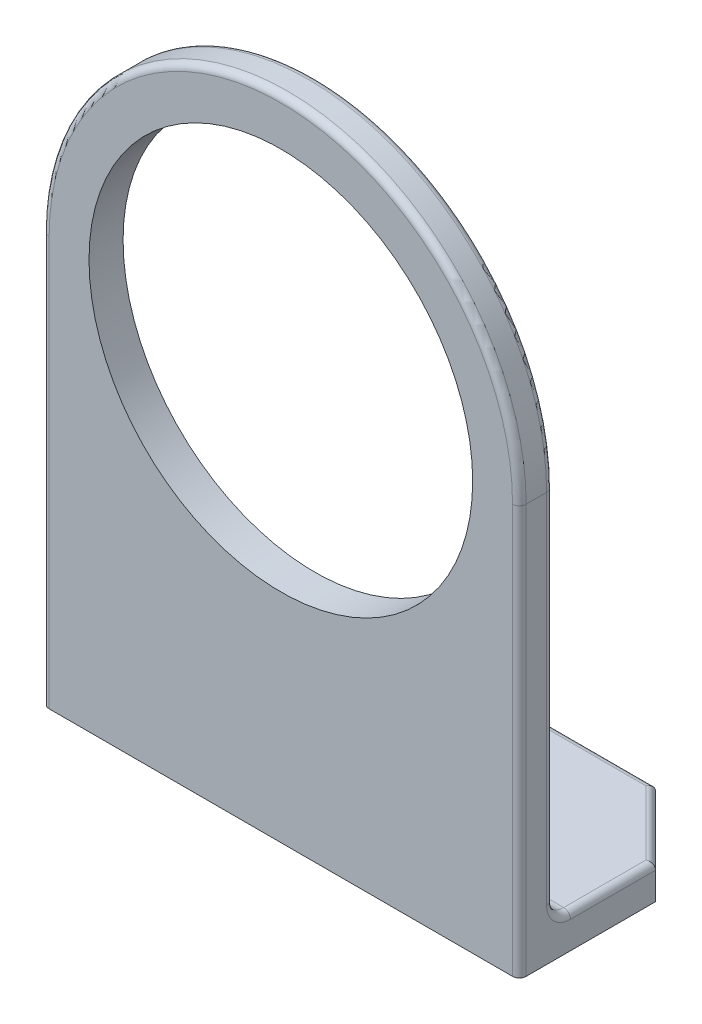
ISO-10303-21;
HEADER;
FILE_DESCRIPTION(('STEP AP214'),'2;1');
FILE_NAME('part.step','',(''),(''),'','','');
FILE_SCHEMA(('AUTOMOTIVE_DESIGN { 1 0 10303 214 1 1 1 1 }'));
ENDSEC;
DATA;
#1=APPLICATION_CONTEXT('core data for automotive mechanical design processes');
#2=APPLICATION_PROTOCOL_DEFINITION('international standard','automotive_design',2000,#1);
#3=PRODUCT_CONTEXT('',#1,'mechanical');
#4=PRODUCT('Part','Part','',(#3));
#5=PRODUCT_RELATED_PRODUCT_CATEGORY('part','',(#4));
#6=PRODUCT_DEFINITION_FORMATION('','',#4);
#7=PRODUCT_DEFINITION_CONTEXT('part definition',#1,'design');
#8=PRODUCT_DEFINITION('design','',#6,#7);
#9=PRODUCT_DEFINITION_SHAPE('','',#8);
#10=(LENGTH_UNIT() NAMED_UNIT(*) SI_UNIT(.MILLI.,.METRE.));
#11=(NAMED_UNIT(*) PLANE_ANGLE_UNIT() SI_UNIT($,.RADIAN.));
#12=(NAMED_UNIT(*) SI_UNIT($,.STERADIAN.) SOLID_ANGLE_UNIT());
#13=UNCERTAINTY_MEASURE_WITH_UNIT(LENGTH_MEASURE(1.E-05),#10,'distance_accuracy_value','');
#14=(GEOMETRIC_REPRESENTATION_CONTEXT(3) GLOBAL_UNCERTAINTY_ASSIGNED_CONTEXT((#13)) GLOBAL_UNIT_ASSIGNED_CONTEXT((#10,
#11,#12)) REPRESENTATION_CONTEXT('',''));
#15=CARTESIAN_POINT('',(0.,0.,0.));
#16=DIRECTION('',(0.,0.,1.));
#17=DIRECTION('',(1.,0.,0.));
#18=AXIS2_PLACEMENT_3D('',#15,#16,#17);
#19=CARTESIAN_POINT('',(-116.709331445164,-76.2,6.35));
#20=DIRECTION('',(0.,-1.,0.));
#21=DIRECTION('',(0.,0.,-1.));
#22=AXIS2_PLACEMENT_3D('',#19,#20,#21);
#23=PLANE('',#22);
#24=CARTESIAN_POINT('',(-22.225,-76.2,-9.52767255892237));
#25=DIRECTION('',(0.,1.,0.));
#26=DIRECTION('',(0.,0.,-1.));
#27=AXIS2_PLACEMENT_3D('',#24,#25,#26);
#28=CIRCLE('',#27,3.2512);
#29=CARTESIAN_POINT('',(-22.225,-76.2,-12.7788725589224));
#30=VERTEX_POINT('',#29);
#31=EDGE_CURVE('E637',#30,#30,#28,.T.);
#32=ORIENTED_EDGE('',*,*,#31,.T.);
#33=EDGE_LOOP('',(#32));
#34=FACE_BOUND('',#33,.T.);
#35=CARTESIAN_POINT('',(22.225,-76.2,-9.52767255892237));
#36=DIRECTION('',(0.,1.,0.));
#37=DIRECTION('',(0.,0.,1.));
#38=AXIS2_PLACEMENT_3D('',#35,#36,#37);
#39=CIRCLE('',#38,3.2512);
#40=CARTESIAN_POINT('',(22.225,-76.2,-6.27647255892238));
#41=VERTEX_POINT('',#40);
#42=EDGE_CURVE('E633',#41,#41,#39,.T.);
#43=ORIENTED_EDGE('',*,*,#42,.T.);
#44=EDGE_LOOP('',(#43));
#45=FACE_BOUND('',#44,.T.);
#46=CARTESIAN_POINT('',(0.,-76.2,-23.8151725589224));
#47=DIRECTION('',(0.,1.,0.));
#48=DIRECTION('',(0.,0.,1.));
#49=AXIS2_PLACEMENT_3D('',#46,#47,#48);
#50=CIRCLE('',#49,3.2512);
#51=CARTESIAN_POINT('',(0.,-76.2,-20.5639725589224));
#52=VERTEX_POINT('',#51);
#53=EDGE_CURVE('E166',#52,#52,#50,.T.);
#54=ORIENTED_EDGE('',*,*,#53,.T.);
#55=EDGE_LOOP('',(#54));
#56=FACE_BOUND('',#55,.T.);
#57=DIRECTION('',(0.,0.,-1.));
#58=VECTOR('',#57,1.);
#59=CARTESIAN_POINT('',(44.45,-76.2,6.35));
#60=LINE('',#59,#58);
#61=CARTESIAN_POINT('',(44.45,-76.2,5.08));
#62=VERTEX_POINT('',#61);
#63=CARTESIAN_POINT('',(44.45,-76.2,-19.05));
#64=VERTEX_POINT('',#63);
#65=EDGE_CURVE('E152',#62,#64,#60,.T.);
#66=ORIENTED_EDGE('',*,*,#65,.F.);
#67=CARTESIAN_POINT('',(43.18,-76.2,5.08));
#68=DIRECTION('',(0.,-1.,0.));
#69=DIRECTION('',(0.,0.,-1.));
#70=AXIS2_PLACEMENT_3D('',#67,#68,#69);
#71=CIRCLE('',#70,1.27);
#72=CARTESIAN_POINT('',(43.18,-76.2,6.35));
#73=VERTEX_POINT('',#72);
#74=EDGE_CURVE('E219',#62,#73,#71,.T.);
#75=ORIENTED_EDGE('',*,*,#74,.T.);
#76=DIRECTION('',(-1.,0.,0.));
#77=VECTOR('',#76,1.);
#78=CARTESIAN_POINT('',(-116.709331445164,-76.2,6.35));
#79=LINE('',#78,#77);
#80=CARTESIAN_POINT('',(-43.18,-76.2,6.35));
#81=VERTEX_POINT('',#80);
#82=EDGE_CURVE('E169',#73,#81,#79,.T.);
#83=ORIENTED_EDGE('',*,*,#82,.T.);
#84=CARTESIAN_POINT('',(-43.18,-76.2,5.08));
#85=DIRECTION('',(0.,-1.,0.));
#86=DIRECTION('',(0.,0.,-1.));
#87=AXIS2_PLACEMENT_3D('',#84,#85,#86);
#88=CIRCLE('',#87,1.27);
#89=CARTESIAN_POINT('',(-44.45,-76.2,5.08));
#90=VERTEX_POINT('',#89);
#91=EDGE_CURVE('E217',#81,#90,#88,.T.);
#92=ORIENTED_EDGE('',*,*,#91,.T.);
#93=DIRECTION('',(0.,0.,-1.));
#94=VECTOR('',#93,1.);
#95=CARTESIAN_POINT('',(-44.45,-76.2,6.35));
#96=LINE('',#95,#94);
#97=CARTESIAN_POINT('',(-44.45,-76.2,-19.05));
#98=VERTEX_POINT('',#97);
#99=EDGE_CURVE('E180',#90,#98,#96,.T.);
#100=ORIENTED_EDGE('',*,*,#99,.T.);
#101=DIRECTION('',(0.707106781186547,0.,-0.707106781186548));
#102=VECTOR('',#101,1.);
#103=CARTESIAN_POINT('',(-93.2796657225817,-76.2,29.7796657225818));
#104=LINE('',#103,#102);
#105=CARTESIAN_POINT('',(-31.75,-76.2,-31.75));
#106=VERTEX_POINT('',#105);
#107=EDGE_CURVE('E164',#98,#106,#104,.T.);
#108=ORIENTED_EDGE('',*,*,#107,.T.);
#109=DIRECTION('',(-1.,0.,0.));
#110=VECTOR('',#109,1.);
#111=CARTESIAN_POINT('',(44.45,-76.2,-31.75));
#112=LINE('',#111,#110);
#113=CARTESIAN_POINT('',(31.75,-76.2,-31.75));
#114=VERTEX_POINT('',#113);
#115=EDGE_CURVE('E148',#114,#106,#112,.T.);
#116=ORIENTED_EDGE('',*,*,#115,.F.);
#117=DIRECTION('',(-0.707106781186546,0.,-0.707106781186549));
#118=VECTOR('',#117,1.);
#119=CARTESIAN_POINT('',(-23.4296657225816,-76.2,-86.9296657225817));
#120=LINE('',#119,#118);
#121=EDGE_CURVE('E151',#114,#64,#120,.F.);
#122=ORIENTED_EDGE('',*,*,#121,.T.);
#123=EDGE_LOOP('',(#66,#75,#83,#92,#100,#108,#116,#122));
#124=FACE_BOUND('',#123,.T.);
#125=ADVANCED_FACE('F32',(#34,#45,#56,#124),#23,.T.);
#126=CARTESIAN_POINT('',(44.45,-15.875,6.35));
#127=DIRECTION('',(-1.,0.,0.));
#128=DIRECTION('',(0.,-1.,0.));
#129=AXIS2_PLACEMENT_3D('',#126,#127,#128);
#130=PLANE('',#129);
#131=DIRECTION('',(0.,0.,-1.));
#132=VECTOR('',#131,1.);
#133=CARTESIAN_POINT('',(44.45,0.,6.35));
#134=LINE('',#133,#132);
#135=CARTESIAN_POINT('',(44.45,0.,5.08));
#136=VERTEX_POINT('',#135);
#137=CARTESIAN_POINT('',(44.45,0.,1.27));
#138=VERTEX_POINT('',#137);
#139=EDGE_CURVE('E186',#136,#138,#134,.T.);
#140=ORIENTED_EDGE('',*,*,#139,.F.);
#141=DIRECTION('',(0.,1.,0.));
#142=VECTOR('',#141,1.);
#143=CARTESIAN_POINT('',(44.45,-15.875,5.08));
#144=LINE('',#143,#142);
#145=EDGE_CURVE('E215',#136,#62,#144,.F.);
#146=ORIENTED_EDGE('',*,*,#145,.T.);
#147=ORIENTED_EDGE('',*,*,#65,.T.);
#148=DIRECTION('',(0.,1.,0.));
#149=VECTOR('',#148,1.);
#150=CARTESIAN_POINT('',(44.45,-15.875,-19.05));
#151=LINE('',#150,#149);
#152=CARTESIAN_POINT('',(44.45,-71.12,-19.05));
#153=VERTEX_POINT('',#152);
#154=EDGE_CURVE('E158',#64,#153,#151,.T.);
#155=ORIENTED_EDGE('',*,*,#154,.T.);
#156=DIRECTION('',(0.,0.,1.));
#157=VECTOR('',#156,1.);
#158=CARTESIAN_POINT('',(44.45,-71.12,6.35));
#159=LINE('',#158,#157);
#160=CARTESIAN_POINT('',(44.45,-71.12,-3.175));
#161=VERTEX_POINT('',#160);
#162=EDGE_CURVE('E209',#153,#161,#159,.T.);
#163=ORIENTED_EDGE('',*,*,#162,.T.);
#164=CARTESIAN_POINT('',(44.45,-66.675,-3.175));
#165=DIRECTION('',(-1.,0.,0.));
#166=DIRECTION('',(0.,-1.,0.));
#167=AXIS2_PLACEMENT_3D('',#164,#165,#166);
#168=CIRCLE('',#167,4.445);
#169=CARTESIAN_POINT('',(44.45,-66.675,1.27));
#170=VERTEX_POINT('',#169);
#171=EDGE_CURVE('E211',#161,#170,#168,.T.);
#172=ORIENTED_EDGE('',*,*,#171,.T.);
#173=DIRECTION('',(0.,1.,0.));
#174=VECTOR('',#173,1.);
#175=CARTESIAN_POINT('',(44.45,0.,1.27));
#176=LINE('',#175,#174);
#177=EDGE_CURVE('E213',#170,#138,#176,.T.);
#178=ORIENTED_EDGE('',*,*,#177,.T.);
#179=EDGE_LOOP('',(#140,#146,#147,#155,#163,#172,#178));
#180=FACE_BOUND('',#179,.T.);
#181=ADVANCED_FACE('F341',(#180),#130,.F.);
#182=CARTESIAN_POINT('',(0.,0.,6.35));
#183=DIRECTION('',(0.,0.,-1.));
#184=DIRECTION('',(-1.,0.,0.));
#185=AXIS2_PLACEMENT_3D('',#182,#183,#184);
#186=CYLINDRICAL_SURFACE('',#185,44.45);
#187=DIRECTION('',(0.,0.,-1.));
#188=VECTOR('',#187,1.);
#189=CARTESIAN_POINT('',(-44.45,0.,6.35));
#190=LINE('',#189,#188);
#191=CARTESIAN_POINT('',(-44.45,0.,5.08));
#192=VERTEX_POINT('',#191);
#193=CARTESIAN_POINT('',(-44.45,0.,1.27));
#194=VERTEX_POINT('',#193);
#195=EDGE_CURVE('E183',#192,#194,#190,.T.);
#196=ORIENTED_EDGE('',*,*,#195,.F.);
#197=CARTESIAN_POINT('',(0.,0.,5.08));
#198=DIRECTION('',(0.,0.,-1.));
#199=DIRECTION('',(-1.,0.,0.));
#200=AXIS2_PLACEMENT_3D('',#197,#198,#199);
#201=CIRCLE('',#200,44.45);
#202=EDGE_CURVE('E223',#192,#136,#201,.T.);
#203=ORIENTED_EDGE('',*,*,#202,.T.);
#204=ORIENTED_EDGE('',*,*,#139,.T.);
#205=CARTESIAN_POINT('',(0.,0.,1.27));
#206=DIRECTION('',(0.,0.,-1.));
#207=DIRECTION('',(-1.,0.,0.));
#208=AXIS2_PLACEMENT_3D('',#205,#206,#207);
#209=CIRCLE('',#208,44.45);
#210=EDGE_CURVE('E221',#138,#194,#209,.F.);
#211=ORIENTED_EDGE('',*,*,#210,.T.);
#212=EDGE_LOOP('',(#196,#203,#204,#211));
#213=FACE_BOUND('',#212,.T.);
#214=ADVANCED_FACE('F344',(#213),#186,.T.);
#215=CARTESIAN_POINT('',(-44.45,-15.875,6.35));
#216=DIRECTION('',(-1.,0.,0.));
#217=DIRECTION('',(0.,-1.,0.));
#218=AXIS2_PLACEMENT_3D('',#215,#216,#217);
#219=PLANE('',#218);
#220=ORIENTED_EDGE('',*,*,#99,.F.);
#221=DIRECTION('',(0.,1.,0.));
#222=VECTOR('',#221,1.);
#223=CARTESIAN_POINT('',(-44.45,0.,5.08));
#224=LINE('',#223,#222);
#225=EDGE_CURVE('E232',#90,#192,#224,.T.);
#226=ORIENTED_EDGE('',*,*,#225,.T.);
#227=ORIENTED_EDGE('',*,*,#195,.T.);
#228=DIRECTION('',(0.,1.,0.));
#229=VECTOR('',#228,1.);
#230=CARTESIAN_POINT('',(-44.45,-15.875,1.27));
#231=LINE('',#230,#229);
#232=CARTESIAN_POINT('',(-44.45,-66.675,1.27));
#233=VERTEX_POINT('',#232);
#234=EDGE_CURVE('E230',#194,#233,#231,.F.);
#235=ORIENTED_EDGE('',*,*,#234,.T.);
#236=CARTESIAN_POINT('',(-44.45,-66.675,-3.175));
#237=DIRECTION('',(-1.,0.,0.));
#238=DIRECTION('',(0.,-1.,0.));
#239=AXIS2_PLACEMENT_3D('',#236,#237,#238);
#240=CIRCLE('',#239,4.445);
#241=CARTESIAN_POINT('',(-44.45,-71.12,-3.175));
#242=VERTEX_POINT('',#241);
#243=EDGE_CURVE('E227',#233,#242,#240,.F.);
#244=ORIENTED_EDGE('',*,*,#243,.T.);
#245=DIRECTION('',(0.,0.,1.));
#246=VECTOR('',#245,1.);
#247=CARTESIAN_POINT('',(-44.45,-71.12,-19.05));
#248=LINE('',#247,#246);
#249=CARTESIAN_POINT('',(-44.45,-71.12,-19.05));
#250=VERTEX_POINT('',#249);
#251=EDGE_CURVE('E225',#242,#250,#248,.F.);
#252=ORIENTED_EDGE('',*,*,#251,.T.);
#253=DIRECTION('',(0.,-1.,0.));
#254=VECTOR('',#253,1.);
#255=CARTESIAN_POINT('',(-44.45,-76.2,-19.05));
#256=LINE('',#255,#254);
#257=EDGE_CURVE('E193',#250,#98,#256,.T.);
#258=ORIENTED_EDGE('',*,*,#257,.T.);
#259=EDGE_LOOP('',(#220,#226,#227,#235,#244,#252,#258));
#260=FACE_BOUND('',#259,.T.);
#261=ADVANCED_FACE('F321',(#260),#219,.T.);
#262=CARTESIAN_POINT('',(0.,0.,6.35));
#263=DIRECTION('',(0.,0.,-1.));
#264=DIRECTION('',(-1.,0.,0.));
#265=AXIS2_PLACEMENT_3D('',#262,#263,#264);
#266=CYLINDRICAL_SURFACE('',#265,35.75);
#267=CARTESIAN_POINT('',(0.,0.,6.35));
#268=DIRECTION('',(0.,0.,-1.));
#269=DIRECTION('',(-1.,0.,0.));
#270=AXIS2_PLACEMENT_3D('',#267,#268,#269);
#271=CIRCLE('',#270,35.75);
#272=CARTESIAN_POINT('',(-35.75,0.,6.35));
#273=VERTEX_POINT('',#272);
#274=EDGE_CURVE('E178',#273,#273,#271,.T.);
#275=ORIENTED_EDGE('',*,*,#274,.F.);
#276=EDGE_LOOP('',(#275));
#277=FACE_BOUND('',#276,.T.);
#278=CARTESIAN_POINT('',(0.,0.,0.));
#279=DIRECTION('',(0.,0.,-1.));
#280=DIRECTION('',(-1.,0.,0.));
#281=AXIS2_PLACEMENT_3D('',#278,#279,#280);
#282=CIRCLE('',#281,35.75);
#283=CARTESIAN_POINT('',(-35.75,0.,0.));
#284=VERTEX_POINT('',#283);
#285=EDGE_CURVE('E165',#284,#284,#282,.T.);
#286=ORIENTED_EDGE('',*,*,#285,.T.);
#287=EDGE_LOOP('',(#286));
#288=FACE_BOUND('',#287,.T.);
#289=ADVANCED_FACE('F556',(#277,#288),#266,.F.);
#290=CARTESIAN_POINT('',(-116.709331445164,-15.875,6.35));
#291=DIRECTION('',(0.,0.,-1.));
#292=DIRECTION('',(-1.,0.,0.));
#293=AXIS2_PLACEMENT_3D('',#290,#291,#292);
#294=PLANE('',#293);
#295=ORIENTED_EDGE('',*,*,#82,.F.);
#296=DIRECTION('',(0.,1.,0.));
#297=VECTOR('',#296,1.);
#298=CARTESIAN_POINT('',(43.18,-15.875,6.35));
#299=LINE('',#298,#297);
#300=CARTESIAN_POINT('',(43.18,0.,6.35));
#301=VERTEX_POINT('',#300);
#302=EDGE_CURVE('E206',#73,#301,#299,.T.);
#303=ORIENTED_EDGE('',*,*,#302,.T.);
#304=CARTESIAN_POINT('',(0.,0.,6.35));
#305=DIRECTION('',(0.,0.,-1.));
#306=DIRECTION('',(-1.,0.,0.));
#307=AXIS2_PLACEMENT_3D('',#304,#305,#306);
#308=CIRCLE('',#307,43.18);
#309=CARTESIAN_POINT('',(-43.18,0.,6.35));
#310=VERTEX_POINT('',#309);
#311=EDGE_CURVE('E204',#301,#310,#308,.F.);
#312=ORIENTED_EDGE('',*,*,#311,.T.);
#313=DIRECTION('',(0.,1.,0.));
#314=VECTOR('',#313,1.);
#315=CARTESIAN_POINT('',(-43.18,-76.2,6.35));
#316=LINE('',#315,#314);
#317=EDGE_CURVE('E202',#310,#81,#316,.F.);
#318=ORIENTED_EDGE('',*,*,#317,.T.);
#319=EDGE_LOOP('',(#295,#303,#312,#318));
#320=FACE_BOUND('',#319,.T.);
#321=ORIENTED_EDGE('',*,*,#274,.T.);
#322=EDGE_LOOP('',(#321));
#323=FACE_BOUND('',#322,.T.);
#324=ADVANCED_FACE('F358',(#320,#323),#294,.F.);
#325=CARTESIAN_POINT('',(-116.709331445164,-15.875,0.));
#326=DIRECTION('',(0.,0.,-1.));
#327=DIRECTION('',(-1.,0.,0.));
#328=AXIS2_PLACEMENT_3D('',#325,#326,#327);
#329=PLANE('',#328);
#330=DIRECTION('',(1.,0.,0.));
#331=VECTOR('',#330,1.);
#332=CARTESIAN_POINT('',(-116.709331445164,-66.675,0.));
#333=LINE('',#332,#331);
#334=CARTESIAN_POINT('',(43.18,-66.675,0.));
#335=VERTEX_POINT('',#334);
#336=CARTESIAN_POINT('',(-43.18,-66.675,0.));
#337=VERTEX_POINT('',#336);
#338=EDGE_CURVE('E199',#335,#337,#333,.F.);
#339=ORIENTED_EDGE('',*,*,#338,.T.);
#340=DIRECTION('',(0.,1.,0.));
#341=VECTOR('',#340,1.);
#342=CARTESIAN_POINT('',(-43.18,-15.875,0.));
#343=LINE('',#342,#341);
#344=CARTESIAN_POINT('',(-43.18,0.,0.));
#345=VERTEX_POINT('',#344);
#346=EDGE_CURVE('E243',#337,#345,#343,.T.);
#347=ORIENTED_EDGE('',*,*,#346,.T.);
#348=CARTESIAN_POINT('',(0.,0.,0.));
#349=DIRECTION('',(0.,0.,-1.));
#350=DIRECTION('',(-1.,0.,0.));
#351=AXIS2_PLACEMENT_3D('',#348,#349,#350);
#352=CIRCLE('',#351,43.18);
#353=CARTESIAN_POINT('',(43.18,0.,0.));
#354=VERTEX_POINT('',#353);
#355=EDGE_CURVE('E241',#345,#354,#352,.T.);
#356=ORIENTED_EDGE('',*,*,#355,.T.);
#357=DIRECTION('',(0.,1.,0.));
#358=VECTOR('',#357,1.);
#359=CARTESIAN_POINT('',(43.18,-66.675,0.));
#360=LINE('',#359,#358);
#361=EDGE_CURVE('E239',#354,#335,#360,.F.);
#362=ORIENTED_EDGE('',*,*,#361,.T.);
#363=EDGE_LOOP('',(#339,#347,#356,#362));
#364=FACE_BOUND('',#363,.T.);
#365=ORIENTED_EDGE('',*,*,#285,.F.);
#366=EDGE_LOOP('',(#365));
#367=FACE_BOUND('',#366,.T.);
#368=ADVANCED_FACE('F329',(#364,#367),#329,.T.);
#369=CARTESIAN_POINT('',(44.45,-69.85,-31.75));
#370=DIRECTION('',(0.,-1.,0.));
#371=DIRECTION('',(0.,0.,-1.));
#372=AXIS2_PLACEMENT_3D('',#369,#370,#371);
#373=PLANE('',#372);
#374=CARTESIAN_POINT('',(-22.225,-69.85,-9.52767255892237));
#375=DIRECTION('',(0.,1.,0.));
#376=DIRECTION('',(0.,0.,-1.));
#377=AXIS2_PLACEMENT_3D('',#374,#375,#376);
#378=CIRCLE('',#377,3.2512);
#379=CARTESIAN_POINT('',(-22.225,-69.85,-12.7788725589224));
#380=VERTEX_POINT('',#379);
#381=EDGE_CURVE('E263',#380,#380,#378,.T.);
#382=ORIENTED_EDGE('',*,*,#381,.F.);
#383=EDGE_LOOP('',(#382));
#384=FACE_BOUND('',#383,.T.);
#385=CARTESIAN_POINT('',(22.225,-69.85,-9.52767255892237));
#386=DIRECTION('',(0.,1.,0.));
#387=DIRECTION('',(0.,0.,1.));
#388=AXIS2_PLACEMENT_3D('',#385,#386,#387);
#389=CIRCLE('',#388,3.2512);
#390=CARTESIAN_POINT('',(22.225,-69.85,-6.27647255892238));
#391=VERTEX_POINT('',#390);
#392=EDGE_CURVE('E629',#391,#391,#389,.T.);
#393=ORIENTED_EDGE('',*,*,#392,.F.);
#394=EDGE_LOOP('',(#393));
#395=FACE_BOUND('',#394,.T.);
#396=CARTESIAN_POINT('',(0.,-69.85,-23.8151725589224));
#397=DIRECTION('',(0.,1.,0.));
#398=DIRECTION('',(0.,0.,1.));
#399=AXIS2_PLACEMENT_3D('',#396,#397,#398);
#400=CIRCLE('',#399,3.2512);
#401=CARTESIAN_POINT('',(0.,-69.85,-20.5639725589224));
#402=VERTEX_POINT('',#401);
#403=EDGE_CURVE('E172',#402,#402,#400,.T.);
#404=ORIENTED_EDGE('',*,*,#403,.F.);
#405=EDGE_LOOP('',(#404));
#406=FACE_BOUND('',#405,.T.);
#407=DIRECTION('',(1.,0.,0.));
#408=VECTOR('',#407,1.);
#409=CARTESIAN_POINT('',(44.45,-69.85,-3.175));
#410=LINE('',#409,#408);
#411=CARTESIAN_POINT('',(-43.18,-69.85,-3.175));
#412=VERTEX_POINT('',#411);
#413=CARTESIAN_POINT('',(43.18,-69.85,-3.175));
#414=VERTEX_POINT('',#413);
#415=EDGE_CURVE('E196',#412,#414,#410,.T.);
#416=ORIENTED_EDGE('',*,*,#415,.T.);
#417=DIRECTION('',(0.,0.,1.));
#418=VECTOR('',#417,1.);
#419=CARTESIAN_POINT('',(43.18,-69.85,-31.75));
#420=LINE('',#419,#418);
#421=CARTESIAN_POINT('',(43.18,-69.85,-18.5239487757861));
#422=VERTEX_POINT('',#421);
#423=EDGE_CURVE('E253',#414,#422,#420,.F.);
#424=ORIENTED_EDGE('',*,*,#423,.T.);
#425=DIRECTION('',(0.707106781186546,0.,0.707106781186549));
#426=VECTOR('',#425,1.);
#427=CARTESIAN_POINT('',(30.8519743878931,-69.85,-30.8519743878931));
#428=LINE('',#427,#426);
#429=CARTESIAN_POINT('',(31.2239487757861,-69.85,-30.48));
#430=VERTEX_POINT('',#429);
#431=EDGE_CURVE('E251',#422,#430,#428,.F.);
#432=ORIENTED_EDGE('',*,*,#431,.T.);
#433=DIRECTION('',(1.,0.,0.));
#434=VECTOR('',#433,1.);
#435=CARTESIAN_POINT('',(44.45,-69.85,-30.48));
#436=LINE('',#435,#434);
#437=CARTESIAN_POINT('',(-31.2239487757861,-69.85,-30.48));
#438=VERTEX_POINT('',#437);
#439=EDGE_CURVE('E249',#430,#438,#436,.F.);
#440=ORIENTED_EDGE('',*,*,#439,.T.);
#441=DIRECTION('',(-0.707106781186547,0.,0.707106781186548));
#442=VECTOR('',#441,1.);
#443=CARTESIAN_POINT('',(-43.5519743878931,-69.85,-18.1519743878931));
#444=LINE('',#443,#442);
#445=CARTESIAN_POINT('',(-43.18,-69.85,-18.5239487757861));
#446=VERTEX_POINT('',#445);
#447=EDGE_CURVE('E247',#438,#446,#444,.T.);
#448=ORIENTED_EDGE('',*,*,#447,.T.);
#449=DIRECTION('',(0.,0.,1.));
#450=VECTOR('',#449,1.);
#451=CARTESIAN_POINT('',(-43.18,-69.85,-3.175));
#452=LINE('',#451,#450);
#453=EDGE_CURVE('E245',#446,#412,#452,.T.);
#454=ORIENTED_EDGE('',*,*,#453,.T.);
#455=EDGE_LOOP('',(#416,#424,#432,#440,#448,#454));
#456=FACE_BOUND('',#455,.T.);
#457=ADVANCED_FACE('F301',(#384,#395,#406,#456),#373,.F.);
#458=CARTESIAN_POINT('',(-44.45,-76.2,-31.75));
#459=DIRECTION('',(0.,0.,1.));
#460=DIRECTION('',(1.,0.,0.));
#461=AXIS2_PLACEMENT_3D('',#458,#459,#460);
#462=PLANE('',#461);
#463=DIRECTION('',(0.,1.,0.));
#464=VECTOR('',#463,1.);
#465=CARTESIAN_POINT('',(-31.75,-69.85,-31.75));
#466=LINE('',#465,#464);
#467=CARTESIAN_POINT('',(-31.75,-71.12,-31.75));
#468=VERTEX_POINT('',#467);
#469=EDGE_CURVE('E191',#106,#468,#466,.T.);
#470=ORIENTED_EDGE('',*,*,#469,.T.);
#471=DIRECTION('',(1.,0.,0.));
#472=VECTOR('',#471,1.);
#473=CARTESIAN_POINT('',(-44.45,-71.12,-31.75));
#474=LINE('',#473,#472);
#475=CARTESIAN_POINT('',(31.75,-71.12,-31.75));
#476=VERTEX_POINT('',#475);
#477=EDGE_CURVE('E41',#468,#476,#474,.T.);
#478=ORIENTED_EDGE('',*,*,#477,.T.);
#479=DIRECTION('',(0.,-1.,0.));
#480=VECTOR('',#479,1.);
#481=CARTESIAN_POINT('',(31.75,-76.2,-31.75));
#482=LINE('',#481,#480);
#483=EDGE_CURVE('E144',#476,#114,#482,.T.);
#484=ORIENTED_EDGE('',*,*,#483,.T.);
#485=ORIENTED_EDGE('',*,*,#115,.T.);
#486=EDGE_LOOP('',(#470,#478,#484,#485));
#487=FACE_BOUND('',#486,.T.);
#488=ADVANCED_FACE('F146',(#487),#462,.F.);
#489=CARTESIAN_POINT('',(31.75,-76.2,-31.75));
#490=DIRECTION('',(-0.707106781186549,0.,0.707106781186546));
#491=DIRECTION('',(0.707106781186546,0.,0.707106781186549));
#492=AXIS2_PLACEMENT_3D('',#489,#490,#491);
#493=PLANE('',#492);
#494=ORIENTED_EDGE('',*,*,#483,.F.);
#495=DIRECTION('',(-0.707106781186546,0.,-0.707106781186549));
#496=VECTOR('',#495,1.);
#497=CARTESIAN_POINT('',(44.45,-71.12,-19.05));
#498=LINE('',#497,#496);
#499=EDGE_CURVE('E255',#476,#153,#498,.F.);
#500=ORIENTED_EDGE('',*,*,#499,.T.);
#501=ORIENTED_EDGE('',*,*,#154,.F.);
#502=ORIENTED_EDGE('',*,*,#121,.F.);
#503=EDGE_LOOP('',(#494,#500,#501,#502));
#504=FACE_BOUND('',#503,.T.);
#505=ADVANCED_FACE('F156',(#504),#493,.F.);
#506=CARTESIAN_POINT('',(-31.75,-76.2,-31.75));
#507=DIRECTION('',(-0.707106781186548,0.,-0.707106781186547));
#508=DIRECTION('',(-0.707106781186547,0.,0.707106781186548));
#509=AXIS2_PLACEMENT_3D('',#506,#507,#508);
#510=PLANE('',#509);
#511=ORIENTED_EDGE('',*,*,#257,.F.);
#512=DIRECTION('',(-0.707106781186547,0.,0.707106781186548));
#513=VECTOR('',#512,1.);
#514=CARTESIAN_POINT('',(-31.75,-71.12,-31.75));
#515=LINE('',#514,#513);
#516=EDGE_CURVE('E11',#250,#468,#515,.F.);
#517=ORIENTED_EDGE('',*,*,#516,.T.);
#518=ORIENTED_EDGE('',*,*,#469,.F.);
#519=ORIENTED_EDGE('',*,*,#107,.F.);
#520=EDGE_LOOP('',(#511,#517,#518,#519));
#521=FACE_BOUND('',#520,.T.);
#522=ADVANCED_FACE('F364',(#521),#510,.T.);
#523=CARTESIAN_POINT('',(44.45,-66.675,-3.175));
#524=DIRECTION('',(1.,0.,0.));
#525=DIRECTION('',(0.,0.,-1.));
#526=AXIS2_PLACEMENT_3D('',#523,#524,#525);
#527=CYLINDRICAL_SURFACE('',#526,3.175);
#528=ORIENTED_EDGE('',*,*,#415,.F.);
#529=CARTESIAN_POINT('',(-43.18,-66.675,-3.175));
#530=DIRECTION('',(-1.,0.,0.));
#531=DIRECTION('',(0.,-1.,0.));
#532=AXIS2_PLACEMENT_3D('',#529,#530,#531);
#533=CIRCLE('',#532,3.175);
#534=EDGE_CURVE('E236',#412,#337,#533,.T.);
#535=ORIENTED_EDGE('',*,*,#534,.T.);
#536=ORIENTED_EDGE('',*,*,#338,.F.);
#537=CARTESIAN_POINT('',(43.18,-66.675,-3.175));
#538=DIRECTION('',(-1.,0.,0.));
#539=DIRECTION('',(0.,-1.,0.));
#540=AXIS2_PLACEMENT_3D('',#537,#538,#539);
#541=CIRCLE('',#540,3.175);
#542=EDGE_CURVE('E234',#335,#414,#541,.F.);
#543=ORIENTED_EDGE('',*,*,#542,.T.);
#544=EDGE_LOOP('',(#528,#535,#536,#543));
#545=FACE_BOUND('',#544,.T.);
#546=ADVANCED_FACE('F307',(#545),#527,.F.);
#547=CARTESIAN_POINT('',(0.,-76.2,-23.8151725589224));
#548=DIRECTION('',(0.,1.,0.));
#549=DIRECTION('',(0.,0.,1.));
#550=AXIS2_PLACEMENT_3D('',#547,#548,#549);
#551=CYLINDRICAL_SURFACE('',#550,3.2512);
#552=ORIENTED_EDGE('',*,*,#53,.F.);
#553=EDGE_LOOP('',(#552));
#554=FACE_BOUND('',#553,.T.);
#555=ORIENTED_EDGE('',*,*,#403,.T.);
#556=EDGE_LOOP('',(#555));
#557=FACE_BOUND('',#556,.T.);
#558=ADVANCED_FACE('F397',(#554,#557),#551,.F.);
#559=CARTESIAN_POINT('',(22.225,-76.2,-9.52767255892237));
#560=DIRECTION('',(0.,1.,0.));
#561=DIRECTION('',(0.,0.,1.));
#562=AXIS2_PLACEMENT_3D('',#559,#560,#561);
#563=CYLINDRICAL_SURFACE('',#562,3.2512);
#564=ORIENTED_EDGE('',*,*,#42,.F.);
#565=EDGE_LOOP('',(#564));
#566=FACE_BOUND('',#565,.T.);
#567=ORIENTED_EDGE('',*,*,#392,.T.);
#568=EDGE_LOOP('',(#567));
#569=FACE_BOUND('',#568,.T.);
#570=ADVANCED_FACE('F499',(#566,#569),#563,.F.);
#571=CARTESIAN_POINT('',(-22.225,-76.2,-9.52767255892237));
#572=DIRECTION('',(0.,1.,0.));
#573=DIRECTION('',(0.,0.,1.));
#574=AXIS2_PLACEMENT_3D('',#571,#572,#573);
#575=CYLINDRICAL_SURFACE('',#574,3.2512);
#576=ORIENTED_EDGE('',*,*,#31,.F.);
#577=EDGE_LOOP('',(#576));
#578=FACE_BOUND('',#577,.T.);
#579=ORIENTED_EDGE('',*,*,#381,.T.);
#580=EDGE_LOOP('',(#579));
#581=FACE_BOUND('',#580,.T.);
#582=ADVANCED_FACE('F404',(#578,#581),#575,.F.);
#583=CARTESIAN_POINT('',(-43.18,-15.875,5.08));
#584=DIRECTION('',(0.,-1.,0.));
#585=DIRECTION('',(1.,0.,0.));
#586=AXIS2_PLACEMENT_3D('',#583,#584,#585);
#587=CYLINDRICAL_SURFACE('',#586,1.27);
#588=ORIENTED_EDGE('',*,*,#91,.F.);
#589=ORIENTED_EDGE('',*,*,#317,.F.);
#590=CARTESIAN_POINT('',(-43.18,0.,5.08));
#591=DIRECTION('',(0.,1.,0.));
#592=DIRECTION('',(-1.,0.,0.));
#593=AXIS2_PLACEMENT_3D('',#590,#591,#592);
#594=CIRCLE('',#593,1.27);
#595=EDGE_CURVE('E260',#192,#310,#594,.T.);
#596=ORIENTED_EDGE('',*,*,#595,.F.);
#597=ORIENTED_EDGE('',*,*,#225,.F.);
#598=EDGE_LOOP('',(#588,#589,#596,#597));
#599=FACE_BOUND('',#598,.T.);
#600=ADVANCED_FACE('F362',(#599),#587,.T.);
#601=CARTESIAN_POINT('',(0.,0.,5.08));
#602=DIRECTION('',(0.,0.,-1.));
#603=DIRECTION('',(-1.,0.,0.));
#604=AXIS2_PLACEMENT_3D('',#601,#602,#603);
#605=TOROIDAL_SURFACE('',#604,43.18,1.27);
#606=ORIENTED_EDGE('',*,*,#595,.T.);
#607=ORIENTED_EDGE('',*,*,#311,.F.);
#608=CARTESIAN_POINT('',(43.18,0.,5.08));
#609=DIRECTION('',(0.,-1.,0.));
#610=DIRECTION('',(0.,0.,-1.));
#611=AXIS2_PLACEMENT_3D('',#608,#609,#610);
#612=CIRCLE('',#611,1.27);
#613=EDGE_CURVE('E258',#136,#301,#612,.T.);
#614=ORIENTED_EDGE('',*,*,#613,.F.);
#615=ORIENTED_EDGE('',*,*,#202,.F.);
#616=EDGE_LOOP('',(#606,#607,#614,#615));
#617=FACE_BOUND('',#616,.T.);
#618=ADVANCED_FACE('F349',(#617),#605,.T.);
#619=CARTESIAN_POINT('',(43.18,-15.875,5.08));
#620=DIRECTION('',(0.,1.,0.));
#621=DIRECTION('',(-1.,0.,0.));
#622=AXIS2_PLACEMENT_3D('',#619,#620,#621);
#623=CYLINDRICAL_SURFACE('',#622,1.27);
#624=ORIENTED_EDGE('',*,*,#74,.F.);
#625=ORIENTED_EDGE('',*,*,#145,.F.);
#626=ORIENTED_EDGE('',*,*,#613,.T.);
#627=ORIENTED_EDGE('',*,*,#302,.F.);
#628=EDGE_LOOP('',(#624,#625,#626,#627));
#629=FACE_BOUND('',#628,.T.);
#630=ADVANCED_FACE('F354',(#629),#623,.T.);
#631=CARTESIAN_POINT('',(43.18,-71.12,6.35));
#632=DIRECTION('',(0.,0.,1.));
#633=DIRECTION('',(1.,0.,0.));
#634=AXIS2_PLACEMENT_3D('',#631,#632,#633);
#635=CYLINDRICAL_SURFACE('',#634,1.27);
#636=CARTESIAN_POINT('',(43.18,-71.12,-18.5239487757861));
#637=DIRECTION('',(-0.382683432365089,0.,-0.923879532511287));
#638=DIRECTION('',(-0.923879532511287,0.,0.382683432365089));
#639=AXIS2_PLACEMENT_3D('',#636,#637,#638);
#640=ELLIPSE('',#639,1.37463809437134,1.27);
#641=EDGE_CURVE('E285',#422,#153,#640,.T.);
#642=ORIENTED_EDGE('',*,*,#641,.F.);
#643=ORIENTED_EDGE('',*,*,#423,.F.);
#644=CARTESIAN_POINT('',(43.18,-71.12,-3.175));
#645=DIRECTION('',(0.,0.,1.));
#646=DIRECTION('',(1.,0.,0.));
#647=AXIS2_PLACEMENT_3D('',#644,#645,#646);
#648=CIRCLE('',#647,1.27);
#649=EDGE_CURVE('E36',#161,#414,#648,.T.);
#650=ORIENTED_EDGE('',*,*,#649,.F.);
#651=ORIENTED_EDGE('',*,*,#162,.F.);
#652=EDGE_LOOP('',(#642,#643,#650,#651));
#653=FACE_BOUND('',#652,.T.);
#654=ADVANCED_FACE('F34',(#653),#635,.T.);
#655=CARTESIAN_POINT('',(43.18,-66.675,-3.175));
#656=DIRECTION('',(-1.,0.,0.));
#657=DIRECTION('',(0.,-1.,0.));
#658=AXIS2_PLACEMENT_3D('',#655,#656,#657);
#659=TOROIDAL_SURFACE('',#658,4.445,1.27);
#660=ORIENTED_EDGE('',*,*,#649,.T.);
#661=ORIENTED_EDGE('',*,*,#542,.F.);
#662=CARTESIAN_POINT('',(43.18,-66.675,1.27));
#663=DIRECTION('',(0.,1.,0.));
#664=DIRECTION('',(0.,0.,1.));
#665=AXIS2_PLACEMENT_3D('',#662,#663,#664);
#666=CIRCLE('',#665,1.27);
#667=EDGE_CURVE('E283',#170,#335,#666,.T.);
#668=ORIENTED_EDGE('',*,*,#667,.F.);
#669=ORIENTED_EDGE('',*,*,#171,.F.);
#670=EDGE_LOOP('',(#660,#661,#668,#669));
#671=FACE_BOUND('',#670,.T.);
#672=ADVANCED_FACE('F295',(#671),#659,.T.);
#673=CARTESIAN_POINT('',(37.201974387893,-71.12,-24.5019743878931));
#674=DIRECTION('',(-0.707106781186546,0.,-0.707106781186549));
#675=DIRECTION('',(-0.707106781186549,0.,0.707106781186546));
#676=AXIS2_PLACEMENT_3D('',#673,#674,#675);
#677=CYLINDRICAL_SURFACE('',#676,1.27);
#678=ORIENTED_EDGE('',*,*,#641,.T.);
#679=ORIENTED_EDGE('',*,*,#499,.F.);
#680=CARTESIAN_POINT('',(31.2239487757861,-71.12,-30.48));
#681=DIRECTION('',(0.923879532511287,0.,0.382683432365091));
#682=DIRECTION('',(0.38268343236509,0.,-0.923879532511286));
#683=AXIS2_PLACEMENT_3D('',#680,#681,#682);
#684=ELLIPSE('',#683,1.37463809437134,1.27);
#685=EDGE_CURVE('E280',#430,#476,#684,.F.);
#686=ORIENTED_EDGE('',*,*,#685,.F.);
#687=ORIENTED_EDGE('',*,*,#431,.F.);
#688=EDGE_LOOP('',(#678,#679,#686,#687));
#689=FACE_BOUND('',#688,.T.);
#690=ADVANCED_FACE('F372',(#689),#677,.T.);
#691=CARTESIAN_POINT('',(43.18,-15.875,1.27));
#692=DIRECTION('',(0.,-1.,0.));
#693=DIRECTION('',(1.,0.,0.));
#694=AXIS2_PLACEMENT_3D('',#691,#692,#693);
#695=CYLINDRICAL_SURFACE('',#694,1.27);
#696=ORIENTED_EDGE('',*,*,#667,.T.);
#697=ORIENTED_EDGE('',*,*,#361,.F.);
#698=CARTESIAN_POINT('',(43.18,0.,1.27));
#699=DIRECTION('',(0.,1.,0.));
#700=DIRECTION('',(-1.,0.,0.));
#701=AXIS2_PLACEMENT_3D('',#698,#699,#700);
#702=CIRCLE('',#701,1.27);
#703=EDGE_CURVE('E277',#138,#354,#702,.T.);
#704=ORIENTED_EDGE('',*,*,#703,.F.);
#705=ORIENTED_EDGE('',*,*,#177,.F.);
#706=EDGE_LOOP('',(#696,#697,#704,#705));
#707=FACE_BOUND('',#706,.T.);
#708=ADVANCED_FACE('F338',(#707),#695,.T.);
#709=CARTESIAN_POINT('',(-44.45,-71.12,-30.48));
#710=DIRECTION('',(1.,0.,0.));
#711=DIRECTION('',(0.,0.,-1.));
#712=AXIS2_PLACEMENT_3D('',#709,#710,#711);
#713=CYLINDRICAL_SURFACE('',#712,1.27);
#714=ORIENTED_EDGE('',*,*,#685,.T.);
#715=ORIENTED_EDGE('',*,*,#477,.F.);
#716=CARTESIAN_POINT('',(-31.2239487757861,-71.12,-30.48));
#717=DIRECTION('',(0.923879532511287,0.,-0.38268343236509));
#718=DIRECTION('',(-0.38268343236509,0.,-0.923879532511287));
#719=AXIS2_PLACEMENT_3D('',#716,#717,#718);
#720=ELLIPSE('',#719,1.37463809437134,1.27);
#721=EDGE_CURVE('E274',#438,#468,#720,.F.);
#722=ORIENTED_EDGE('',*,*,#721,.F.);
#723=ORIENTED_EDGE('',*,*,#439,.F.);
#724=EDGE_LOOP('',(#714,#715,#722,#723));
#725=FACE_BOUND('',#724,.T.);
#726=ADVANCED_FACE('F371',(#725),#713,.T.);
#727=CARTESIAN_POINT('',(0.,0.,1.27));
#728=DIRECTION('',(0.,0.,-1.));
#729=DIRECTION('',(-1.,0.,0.));
#730=AXIS2_PLACEMENT_3D('',#727,#728,#729);
#731=TOROIDAL_SURFACE('',#730,43.18,1.27);
#732=ORIENTED_EDGE('',*,*,#703,.T.);
#733=ORIENTED_EDGE('',*,*,#355,.F.);
#734=CARTESIAN_POINT('',(-43.18,0.,1.27));
#735=DIRECTION('',(0.,-1.,0.));
#736=DIRECTION('',(0.,0.,-1.));
#737=AXIS2_PLACEMENT_3D('',#734,#735,#736);
#738=CIRCLE('',#737,1.27);
#739=EDGE_CURVE('E271',#194,#345,#738,.T.);
#740=ORIENTED_EDGE('',*,*,#739,.F.);
#741=ORIENTED_EDGE('',*,*,#210,.F.);
#742=EDGE_LOOP('',(#732,#733,#740,#741));
#743=FACE_BOUND('',#742,.T.);
#744=ADVANCED_FACE('F333',(#743),#731,.T.);
#745=CARTESIAN_POINT('',(7.24802561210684,-71.12,-68.9519743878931));
#746=DIRECTION('',(0.707106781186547,0.,-0.707106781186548));
#747=DIRECTION('',(-0.707106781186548,0.,-0.707106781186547));
#748=AXIS2_PLACEMENT_3D('',#745,#746,#747);
#749=CYLINDRICAL_SURFACE('',#748,1.27);
#750=ORIENTED_EDGE('',*,*,#721,.T.);
#751=ORIENTED_EDGE('',*,*,#516,.F.);
#752=CARTESIAN_POINT('',(-43.18,-71.12,-18.5239487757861));
#753=DIRECTION('',(0.382683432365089,0.,-0.923879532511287));
#754=DIRECTION('',(-0.923879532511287,0.,-0.382683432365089));
#755=AXIS2_PLACEMENT_3D('',#752,#753,#754);
#756=ELLIPSE('',#755,1.37463809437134,1.27);
#757=EDGE_CURVE('E268',#446,#250,#756,.F.);
#758=ORIENTED_EDGE('',*,*,#757,.F.);
#759=ORIENTED_EDGE('',*,*,#447,.F.);
#760=EDGE_LOOP('',(#750,#751,#758,#759));
#761=FACE_BOUND('',#760,.T.);
#762=ADVANCED_FACE('F366',(#761),#749,.T.);
#763=CARTESIAN_POINT('',(-43.18,-15.875,1.27));
#764=DIRECTION('',(0.,1.,0.));
#765=DIRECTION('',(-1.,0.,0.));
#766=AXIS2_PLACEMENT_3D('',#763,#764,#765);
#767=CYLINDRICAL_SURFACE('',#766,1.27);
#768=ORIENTED_EDGE('',*,*,#739,.T.);
#769=ORIENTED_EDGE('',*,*,#346,.F.);
#770=CARTESIAN_POINT('',(-43.18,-66.675,1.27));
#771=DIRECTION('',(0.,-1.,0.));
#772=DIRECTION('',(0.,0.,-1.));
#773=AXIS2_PLACEMENT_3D('',#770,#771,#772);
#774=CIRCLE('',#773,1.27);
#775=EDGE_CURVE('E266',#233,#337,#774,.T.);
#776=ORIENTED_EDGE('',*,*,#775,.F.);
#777=ORIENTED_EDGE('',*,*,#234,.F.);
#778=EDGE_LOOP('',(#768,#769,#776,#777));
#779=FACE_BOUND('',#778,.T.);
#780=ADVANCED_FACE('F326',(#779),#767,.T.);
#781=CARTESIAN_POINT('',(-43.18,-71.12,-31.75));
#782=DIRECTION('',(0.,0.,-1.));
#783=DIRECTION('',(-1.,0.,0.));
#784=AXIS2_PLACEMENT_3D('',#781,#782,#783);
#785=CYLINDRICAL_SURFACE('',#784,1.27);
#786=ORIENTED_EDGE('',*,*,#757,.T.);
#787=ORIENTED_EDGE('',*,*,#251,.F.);
#788=CARTESIAN_POINT('',(-43.18,-71.12,-3.175));
#789=DIRECTION('',(0.,0.,1.));
#790=DIRECTION('',(1.,0.,0.));
#791=AXIS2_PLACEMENT_3D('',#788,#789,#790);
#792=CIRCLE('',#791,1.27);
#793=EDGE_CURVE('E264',#412,#242,#792,.T.);
#794=ORIENTED_EDGE('',*,*,#793,.F.);
#795=ORIENTED_EDGE('',*,*,#453,.F.);
#796=EDGE_LOOP('',(#786,#787,#794,#795));
#797=FACE_BOUND('',#796,.T.);
#798=ADVANCED_FACE('F317',(#797),#785,.T.);
#799=CARTESIAN_POINT('',(-43.18,-66.675,-3.175));
#800=DIRECTION('',(-1.,0.,0.));
#801=DIRECTION('',(0.,-1.,0.));
#802=AXIS2_PLACEMENT_3D('',#799,#800,#801);
#803=TOROIDAL_SURFACE('',#802,4.445,1.27);
#804=ORIENTED_EDGE('',*,*,#775,.T.);
#805=ORIENTED_EDGE('',*,*,#534,.F.);
#806=ORIENTED_EDGE('',*,*,#793,.T.);
#807=ORIENTED_EDGE('',*,*,#243,.F.);
#808=EDGE_LOOP('',(#804,#805,#806,#807));
#809=FACE_BOUND('',#808,.T.);
#810=ADVANCED_FACE('F311',(#809),#803,.T.);
#811=CLOSED_SHELL('',(#125,#181,#214,#261,#289,#324,#368,#457,#488,#505,#522,#546,#558,#570,
#582,#600,#618,#630,#654,#672,#690,#708,#726,#744,#762,#780,#798,#810));
#812=MANIFOLD_SOLID_BREP('B2',#811);
#813=ADVANCED_BREP_SHAPE_REPRESENTATION('',(#18,#812),#14);
#814=SHAPE_DEFINITION_REPRESENTATION(#9,#813);
ENDSEC;
END-ISO-10303-21;
